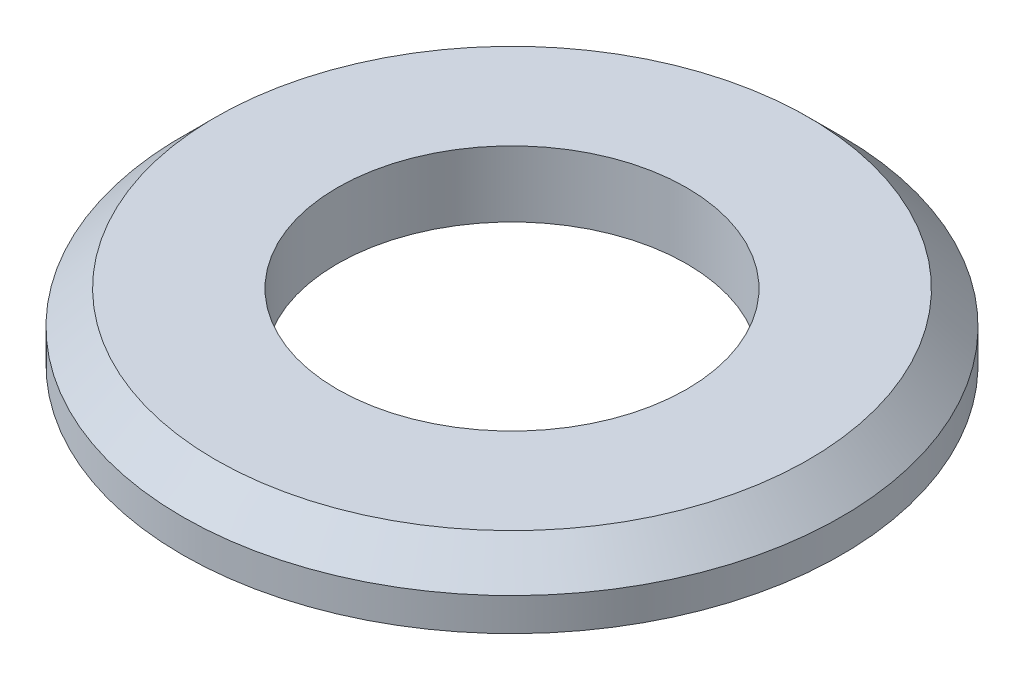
ISO-10303-21;
HEADER;
FILE_DESCRIPTION(('STEP AP214'),'2;1');
FILE_NAME('part.step','',(''),(''),'','','');
FILE_SCHEMA(('AUTOMOTIVE_DESIGN { 1 0 10303 214 1 1 1 1 }'));
ENDSEC;
DATA;
#1=APPLICATION_CONTEXT('core data for automotive mechanical design processes');
#2=APPLICATION_PROTOCOL_DEFINITION('international standard','automotive_design',2000,#1);
#3=PRODUCT_CONTEXT('',#1,'mechanical');
#4=PRODUCT('Part','Part','',(#3));
#5=PRODUCT_RELATED_PRODUCT_CATEGORY('part','',(#4));
#6=PRODUCT_DEFINITION_FORMATION('','',#4);
#7=PRODUCT_DEFINITION_CONTEXT('part definition',#1,'design');
#8=PRODUCT_DEFINITION('design','',#6,#7);
#9=PRODUCT_DEFINITION_SHAPE('','',#8);
#10=(LENGTH_UNIT() NAMED_UNIT(*) SI_UNIT(.MILLI.,.METRE.));
#11=(NAMED_UNIT(*) PLANE_ANGLE_UNIT() SI_UNIT($,.RADIAN.));
#12=(NAMED_UNIT(*) SI_UNIT($,.STERADIAN.) SOLID_ANGLE_UNIT());
#13=UNCERTAINTY_MEASURE_WITH_UNIT(LENGTH_MEASURE(1.E-05),#10,'distance_accuracy_value','');
#14=(GEOMETRIC_REPRESENTATION_CONTEXT(3) GLOBAL_UNCERTAINTY_ASSIGNED_CONTEXT((#13)) GLOBAL_UNIT_ASSIGNED_CONTEXT((#10,
#11,#12)) REPRESENTATION_CONTEXT('',''));
#15=CARTESIAN_POINT('',(0.,0.,0.));
#16=DIRECTION('',(0.,0.,1.));
#17=DIRECTION('',(1.,0.,0.));
#18=AXIS2_PLACEMENT_3D('',#15,#16,#17);
#19=CARTESIAN_POINT('',(0.,1.,0.));
#20=DIRECTION('',(0.,1.,0.));
#21=DIRECTION('',(0.,0.,1.));
#22=AXIS2_PLACEMENT_3D('',#19,#20,#21);
#23=PLANE('',#22);
#24=CARTESIAN_POINT('',(0.,1.,0.));
#25=DIRECTION('',(0.,1.,0.));
#26=DIRECTION('',(0.,0.,1.));
#27=AXIS2_PLACEMENT_3D('',#24,#25,#26);
#28=CIRCLE('',#27,4.5);
#29=CARTESIAN_POINT('',(0.,1.,4.5));
#30=VERTEX_POINT('',#29);
#31=EDGE_CURVE('E35',#30,#30,#28,.T.);
#32=ORIENTED_EDGE('',*,*,#31,.T.);
#33=EDGE_LOOP('',(#32));
#34=FACE_BOUND('',#33,.T.);
#35=CARTESIAN_POINT('',(0.,1.,0.));
#36=DIRECTION('',(0.,1.,0.));
#37=DIRECTION('',(0.,0.,1.));
#38=AXIS2_PLACEMENT_3D('',#35,#36,#37);
#39=CIRCLE('',#38,2.65);
#40=CARTESIAN_POINT('',(0.,1.,2.65));
#41=VERTEX_POINT('',#40);
#42=EDGE_CURVE('E43',#41,#41,#39,.T.);
#43=ORIENTED_EDGE('',*,*,#42,.F.);
#44=EDGE_LOOP('',(#43));
#45=FACE_BOUND('',#44,.T.);
#46=ADVANCED_FACE('F28',(#34,#45),#23,.T.);
#47=CARTESIAN_POINT('',(0.,0.,0.));
#48=DIRECTION('',(0.,1.,0.));
#49=DIRECTION('',(0.,0.,1.));
#50=AXIS2_PLACEMENT_3D('',#47,#48,#49);
#51=PLANE('',#50);
#52=CARTESIAN_POINT('',(0.,0.,0.));
#53=DIRECTION('',(0.,1.,0.));
#54=DIRECTION('',(0.,0.,1.));
#55=AXIS2_PLACEMENT_3D('',#52,#53,#54);
#56=CIRCLE('',#55,5.);
#57=CARTESIAN_POINT('',(0.,0.,5.));
#58=VERTEX_POINT('',#57);
#59=EDGE_CURVE('E39',#58,#58,#56,.T.);
#60=ORIENTED_EDGE('',*,*,#59,.F.);
#61=EDGE_LOOP('',(#60));
#62=FACE_BOUND('',#61,.T.);
#63=CARTESIAN_POINT('',(0.,0.,0.));
#64=DIRECTION('',(0.,1.,0.));
#65=DIRECTION('',(0.,0.,1.));
#66=AXIS2_PLACEMENT_3D('',#63,#64,#65);
#67=CIRCLE('',#66,2.65);
#68=CARTESIAN_POINT('',(0.,0.,2.65));
#69=VERTEX_POINT('',#68);
#70=EDGE_CURVE('E48',#69,#69,#67,.T.);
#71=ORIENTED_EDGE('',*,*,#70,.T.);
#72=EDGE_LOOP('',(#71));
#73=FACE_BOUND('',#72,.T.);
#74=ADVANCED_FACE('F52',(#62,#73),#51,.F.);
#75=CARTESIAN_POINT('',(0.,1.,0.));
#76=DIRECTION('',(0.,-1.,0.));
#77=DIRECTION('',(0.,0.,-1.));
#78=AXIS2_PLACEMENT_3D('',#75,#76,#77);
#79=CYLINDRICAL_SURFACE('',#78,5.);
#80=CARTESIAN_POINT('',(0.,0.499999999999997,0.));
#81=DIRECTION('',(0.,1.,0.));
#82=DIRECTION('',(0.,0.,1.));
#83=AXIS2_PLACEMENT_3D('',#80,#81,#82);
#84=CIRCLE('',#83,5.);
#85=CARTESIAN_POINT('',(0.,0.499999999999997,5.));
#86=VERTEX_POINT('',#85);
#87=EDGE_CURVE('E10',#86,#86,#84,.F.);
#88=ORIENTED_EDGE('',*,*,#87,.T.);
#89=EDGE_LOOP('',(#88));
#90=FACE_BOUND('',#89,.T.);
#91=ORIENTED_EDGE('',*,*,#59,.T.);
#92=EDGE_LOOP('',(#91));
#93=FACE_BOUND('',#92,.T.);
#94=ADVANCED_FACE('F30',(#90,#93),#79,.T.);
#95=CARTESIAN_POINT('',(0.,1.,0.));
#96=DIRECTION('',(0.,-1.,0.));
#97=DIRECTION('',(0.,0.,-1.));
#98=AXIS2_PLACEMENT_3D('',#95,#96,#97);
#99=CYLINDRICAL_SURFACE('',#98,2.65);
#100=ORIENTED_EDGE('',*,*,#42,.T.);
#101=EDGE_LOOP('',(#100));
#102=FACE_BOUND('',#101,.T.);
#103=ORIENTED_EDGE('',*,*,#70,.F.);
#104=EDGE_LOOP('',(#103));
#105=FACE_BOUND('',#104,.T.);
#106=ADVANCED_FACE('F54',(#102,#105),#99,.F.);
#107=CARTESIAN_POINT('',(0.,1.,0.));
#108=DIRECTION('',(0.,-1.,0.));
#109=DIRECTION('',(0.,0.,-1.));
#110=AXIS2_PLACEMENT_3D('',#107,#108,#109);
#111=CONICAL_SURFACE('',#110,4.5,0.785398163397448);
#112=ORIENTED_EDGE('',*,*,#87,.F.);
#113=EDGE_LOOP('',(#112));
#114=FACE_BOUND('',#113,.T.);
#115=ORIENTED_EDGE('',*,*,#31,.F.);
#116=EDGE_LOOP('',(#115));
#117=FACE_BOUND('',#116,.T.);
#118=ADVANCED_FACE('F56',(#114,#117),#111,.T.);
#119=CLOSED_SHELL('',(#46,#74,#94,#106,#118));
#120=MANIFOLD_SOLID_BREP('B2',#119);
#121=ADVANCED_BREP_SHAPE_REPRESENTATION('',(#18,#120),#14);
#122=SHAPE_DEFINITION_REPRESENTATION(#9,#121);
ENDSEC;
END-ISO-10303-21;
